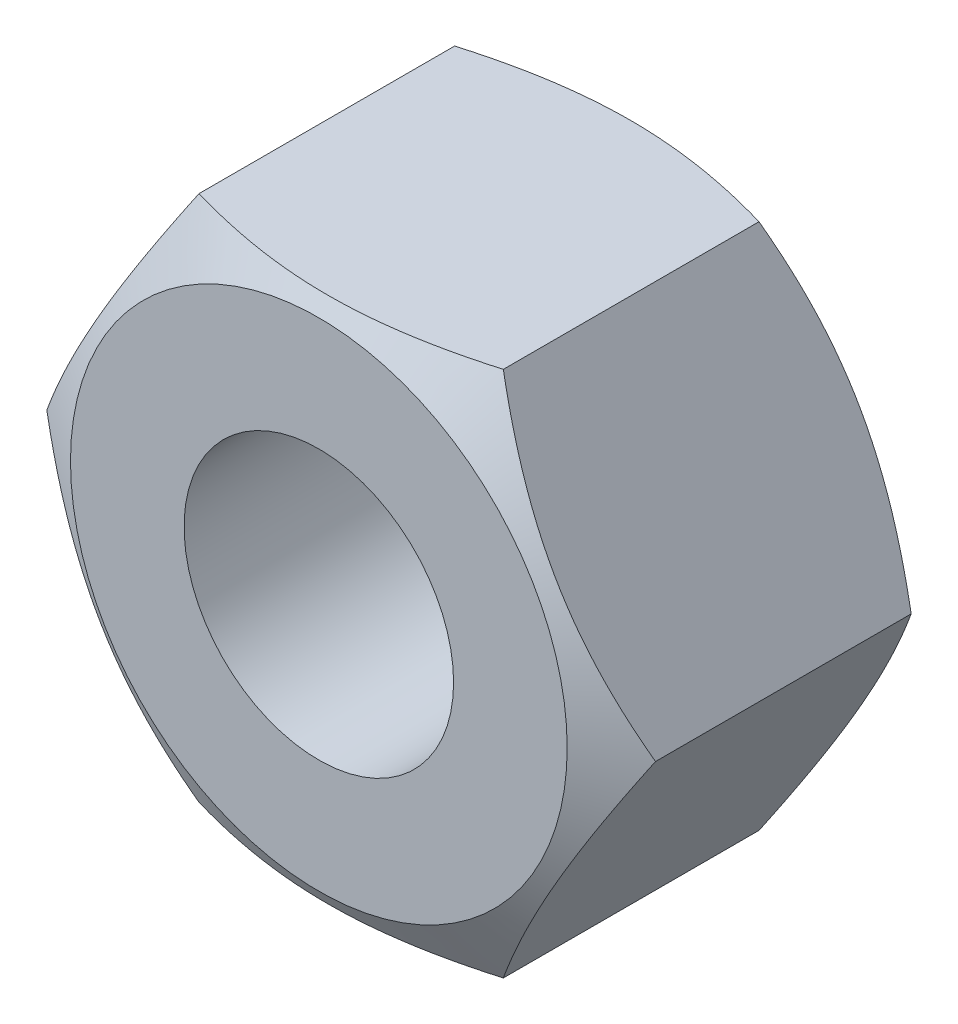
from build123d import *

# Parameters (mm, degrees)
SKETCH1_R     = 3.3235
BASENUT_DEPTH = 7.9


with BuildPart() as part:
    # Sketch1 → BaseNut (new body)
    with BuildSketch(Plane.XY):
        Polygon((3.75277675, -6.5), (7.505553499, 0), (3.75277675, 6.5), (-3.75277675, 6.5), (-7.505553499, 0), (-3.75277675, -6.5), align=None)
        Circle(SKETCH1_R, mode=Mode.SUBTRACT)
    extrude(amount=-BASENUT_DEPTH)

    # Sketch2 → Double-Chamfer (revolve, cut)
    with BuildSketch(Plane(origin=(0, 0, 0), x_dir=(1, 0, 0), z_dir=(0, 1, 0))):
        Polygon((-7.505553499, 7.9), (-6.125, 7.9), (-7.505553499, 7.102937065), align=None)
        Polygon((-7.505553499, 0.797062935), (-7.505553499, 0), (-6.125, 0), align=None)
    revolve(axis=Axis((0, 0, -3.375940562), (0, 0, 1)), mode=Mode.SUBTRACT)


solid = part.part
